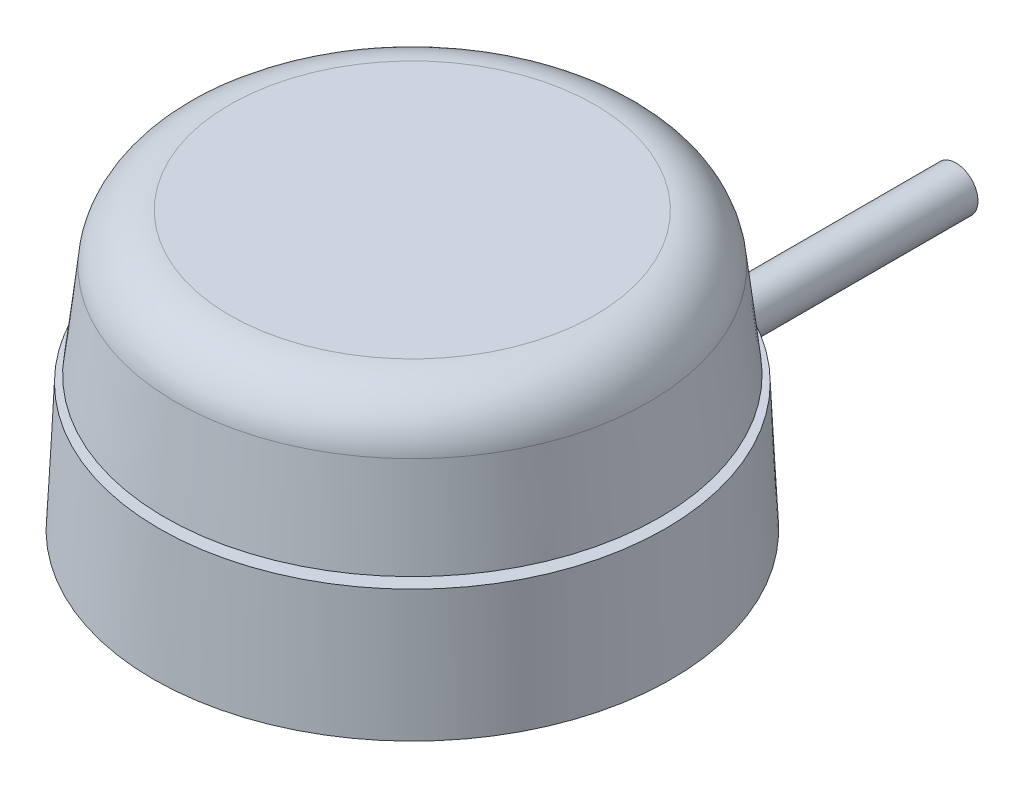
ISO-10303-21;
HEADER;
FILE_DESCRIPTION(('STEP AP214'),'2;1');
FILE_NAME('part.step','',(''),(''),'','','');
FILE_SCHEMA(('AUTOMOTIVE_DESIGN { 1 0 10303 214 1 1 1 1 }'));
ENDSEC;
DATA;
#1=APPLICATION_CONTEXT('core data for automotive mechanical design processes');
#2=APPLICATION_PROTOCOL_DEFINITION('international standard','automotive_design',2000,#1);
#3=PRODUCT_CONTEXT('',#1,'mechanical');
#4=PRODUCT('Part','Part','',(#3));
#5=PRODUCT_RELATED_PRODUCT_CATEGORY('part','',(#4));
#6=PRODUCT_DEFINITION_FORMATION('','',#4);
#7=PRODUCT_DEFINITION_CONTEXT('part definition',#1,'design');
#8=PRODUCT_DEFINITION('design','',#6,#7);
#9=PRODUCT_DEFINITION_SHAPE('','',#8);
#10=(LENGTH_UNIT() NAMED_UNIT(*) SI_UNIT(.MILLI.,.METRE.));
#11=(NAMED_UNIT(*) PLANE_ANGLE_UNIT() SI_UNIT($,.RADIAN.));
#12=(NAMED_UNIT(*) SI_UNIT($,.STERADIAN.) SOLID_ANGLE_UNIT());
#13=UNCERTAINTY_MEASURE_WITH_UNIT(LENGTH_MEASURE(1.E-05),#10,'distance_accuracy_value','');
#14=(GEOMETRIC_REPRESENTATION_CONTEXT(3) GLOBAL_UNCERTAINTY_ASSIGNED_CONTEXT((#13)) GLOBAL_UNIT_ASSIGNED_CONTEXT((#10,
#11,#12)) REPRESENTATION_CONTEXT('',''));
#15=CARTESIAN_POINT('',(0.,0.,0.));
#16=DIRECTION('',(0.,0.,1.));
#17=DIRECTION('',(1.,0.,0.));
#18=AXIS2_PLACEMENT_3D('',#15,#16,#17);
#19=CARTESIAN_POINT('',(1.,-0.00100000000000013,-38.8901171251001));
#20=DIRECTION('',(-1.,0.,0.));
#21=DIRECTION('',(0.,0.,1.));
#22=AXIS2_PLACEMENT_3D('',#19,#20,#21);
#23=PLANE('',#22);
#24=DIRECTION('',(0.,0.,-1.));
#25=VECTOR('',#24,1.);
#26=CARTESIAN_POINT('',(1.,6.59232921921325,-29.697728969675));
#27=LINE('',#26,#25);
#28=CARTESIAN_POINT('',(1.,6.59232921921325,-40.3901171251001));
#29=VERTEX_POINT('',#28);
#30=CARTESIAN_POINT('',(1.,6.59232921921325,-38.8901171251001));
#31=VERTEX_POINT('',#30);
#32=EDGE_CURVE('P0_E255',#29,#31,#27,.F.);
#33=ORIENTED_EDGE('',*,*,#32,.F.);
#34=DIRECTION('',(0.,1.,0.));
#35=VECTOR('',#34,1.);
#36=CARTESIAN_POINT('',(1.,-0.00100000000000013,-40.3901171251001));
#37=LINE('',#36,#35);
#38=CARTESIAN_POINT('',(1.,6.75,-40.3901171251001));
#39=VERTEX_POINT('',#38);
#40=EDGE_CURVE('P0_E361',#29,#39,#37,.T.);
#41=ORIENTED_EDGE('',*,*,#40,.T.);
#42=DIRECTION('',(0.,0.,1.));
#43=VECTOR('',#42,1.);
#44=CARTESIAN_POINT('',(1.,6.75,-38.8901171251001));
#45=LINE('',#44,#43);
#46=CARTESIAN_POINT('',(1.,6.75,-38.8901171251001));
#47=VERTEX_POINT('',#46);
#48=EDGE_CURVE('P0_E356',#39,#47,#45,.T.);
#49=ORIENTED_EDGE('',*,*,#48,.T.);
#50=DIRECTION('',(0.,1.,0.));
#51=VECTOR('',#50,1.);
#52=CARTESIAN_POINT('',(1.,-0.00100000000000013,-38.8901171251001));
#53=LINE('',#52,#51);
#54=EDGE_CURVE('P0_E365',#31,#47,#53,.T.);
#55=ORIENTED_EDGE('',*,*,#54,.F.);
#56=EDGE_LOOP('',(#33,#41,#49,#55));
#57=FACE_BOUND('',#56,.T.);
#58=ADVANCED_FACE('P0_F16',(#57),#23,.F.);
#59=DIRECTION('',(0.,0.,-1.));
#60=VECTOR('',#59,1.);
#61=CARTESIAN_POINT('',(1.,0.407670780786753,-29.697728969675));
#62=LINE('',#61,#60);
#63=CARTESIAN_POINT('',(1.,0.407670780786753,-38.8901171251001));
#64=VERTEX_POINT('',#63);
#65=CARTESIAN_POINT('',(1.,0.407670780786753,-40.3901171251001));
#66=VERTEX_POINT('',#65);
#67=EDGE_CURVE('P0_E39',#64,#66,#62,.T.);
#68=ORIENTED_EDGE('',*,*,#67,.F.);
#69=CARTESIAN_POINT('',(1.,0.25,-38.8901171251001));
#70=VERTEX_POINT('',#69);
#71=EDGE_CURVE('P0_E362',#70,#64,#53,.T.);
#72=ORIENTED_EDGE('',*,*,#71,.F.);
#73=DIRECTION('',(0.,0.,1.));
#74=VECTOR('',#73,1.);
#75=CARTESIAN_POINT('',(1.,0.25,-38.8901171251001));
#76=LINE('',#75,#74);
#77=CARTESIAN_POINT('',(1.,0.25,-40.3901171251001));
#78=VERTEX_POINT('',#77);
#79=EDGE_CURVE('P0_E347',#78,#70,#76,.T.);
#80=ORIENTED_EDGE('',*,*,#79,.F.);
#81=EDGE_CURVE('P0_E366',#78,#66,#37,.T.);
#82=ORIENTED_EDGE('',*,*,#81,.T.);
#83=EDGE_LOOP('',(#68,#72,#80,#82));
#84=FACE_BOUND('',#83,.T.);
#85=ADVANCED_FACE('P0_F532',(#84),#23,.F.);
#86=CARTESIAN_POINT('',(-0.999999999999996,-0.00100000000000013,-43.8901171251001));
#87=DIRECTION('',(1.,0.,0.));
#88=DIRECTION('',(0.,0.,-1.));
#89=AXIS2_PLACEMENT_3D('',#86,#87,#88);
#90=PLANE('',#89);
#91=DIRECTION('',(0.,0.,-1.));
#92=VECTOR('',#91,1.);
#93=CARTESIAN_POINT('',(-1.,0.407670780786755,-29.697728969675));
#94=LINE('',#93,#92);
#95=CARTESIAN_POINT('',(-0.999999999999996,0.407670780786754,-43.8901171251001));
#96=VERTEX_POINT('',#95);
#97=CARTESIAN_POINT('',(-0.999999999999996,0.407670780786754,-42.3901171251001));
#98=VERTEX_POINT('',#97);
#99=EDGE_CURVE('P0_E248',#96,#98,#94,.F.);
#100=ORIENTED_EDGE('',*,*,#99,.F.);
#101=DIRECTION('',(0.,1.,0.));
#102=VECTOR('',#101,1.);
#103=CARTESIAN_POINT('',(-0.999999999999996,-0.00100000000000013,-43.8901171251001));
#104=LINE('',#103,#102);
#105=CARTESIAN_POINT('',(-0.999999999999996,0.249999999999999,-43.8901171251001));
#106=VERTEX_POINT('',#105);
#107=EDGE_CURVE('P0_E333',#106,#96,#104,.T.);
#108=ORIENTED_EDGE('',*,*,#107,.F.);
#109=DIRECTION('',(0.,0.,-1.));
#110=VECTOR('',#109,1.);
#111=CARTESIAN_POINT('',(-0.999999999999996,0.249999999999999,-43.8901171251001));
#112=LINE('',#111,#110);
#113=CARTESIAN_POINT('',(-0.999999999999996,0.249999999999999,-42.3901171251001));
#114=VERTEX_POINT('',#113);
#115=EDGE_CURVE('P0_E318',#114,#106,#112,.T.);
#116=ORIENTED_EDGE('',*,*,#115,.F.);
#117=DIRECTION('',(0.,1.,0.));
#118=VECTOR('',#117,1.);
#119=CARTESIAN_POINT('',(-0.999999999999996,-0.00100000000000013,-42.3901171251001));
#120=LINE('',#119,#118);
#121=EDGE_CURVE('P0_E337',#114,#98,#120,.T.);
#122=ORIENTED_EDGE('',*,*,#121,.T.);
#123=EDGE_LOOP('',(#100,#108,#116,#122));
#124=FACE_BOUND('',#123,.T.);
#125=ADVANCED_FACE('P0_F538',(#124),#90,.F.);
#126=DIRECTION('',(0.,0.,-1.));
#127=VECTOR('',#126,1.);
#128=CARTESIAN_POINT('',(-1.,6.59232921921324,-29.697728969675));
#129=LINE('',#128,#127);
#130=CARTESIAN_POINT('',(-0.999999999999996,6.59232921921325,-42.3901171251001));
#131=VERTEX_POINT('',#130);
#132=CARTESIAN_POINT('',(-0.999999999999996,6.59232921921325,-43.8901171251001));
#133=VERTEX_POINT('',#132);
#134=EDGE_CURVE('P0_E245',#131,#133,#129,.T.);
#135=ORIENTED_EDGE('',*,*,#134,.F.);
#136=CARTESIAN_POINT('',(-0.999999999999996,6.75,-42.3901171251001));
#137=VERTEX_POINT('',#136);
#138=EDGE_CURVE('P0_E332',#131,#137,#120,.T.);
#139=ORIENTED_EDGE('',*,*,#138,.T.);
#140=DIRECTION('',(0.,0.,-1.));
#141=VECTOR('',#140,1.);
#142=CARTESIAN_POINT('',(-0.999999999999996,6.75,-43.8901171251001));
#143=LINE('',#142,#141);
#144=CARTESIAN_POINT('',(-0.999999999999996,6.75,-43.8901171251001));
#145=VERTEX_POINT('',#144);
#146=EDGE_CURVE('P0_E327',#137,#145,#143,.T.);
#147=ORIENTED_EDGE('',*,*,#146,.T.);
#148=EDGE_CURVE('P0_E336',#133,#145,#104,.T.);
#149=ORIENTED_EDGE('',*,*,#148,.F.);
#150=EDGE_LOOP('',(#135,#139,#147,#149));
#151=FACE_BOUND('',#150,.T.);
#152=ADVANCED_FACE('P0_F578',(#151),#90,.F.);
#153=CARTESIAN_POINT('',(1.,-0.00100000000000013,-43.8901171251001));
#154=DIRECTION('',(-1.,0.,0.));
#155=DIRECTION('',(0.,0.,1.));
#156=AXIS2_PLACEMENT_3D('',#153,#154,#155);
#157=PLANE('',#156);
#158=DIRECTION('',(0.,0.,-1.));
#159=VECTOR('',#158,1.);
#160=CARTESIAN_POINT('',(1.,6.59232921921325,-29.697728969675));
#161=LINE('',#160,#159);
#162=CARTESIAN_POINT('',(1.,6.59232921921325,-43.8901171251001));
#163=VERTEX_POINT('',#162);
#164=CARTESIAN_POINT('',(1.,6.59232921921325,-42.3901171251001));
#165=VERTEX_POINT('',#164);
#166=EDGE_CURVE('P0_E234',#163,#165,#161,.F.);
#167=ORIENTED_EDGE('',*,*,#166,.F.);
#168=DIRECTION('',(0.,1.,0.));
#169=VECTOR('',#168,1.);
#170=CARTESIAN_POINT('',(1.,-0.00100000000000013,-43.8901171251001));
#171=LINE('',#170,#169);
#172=CARTESIAN_POINT('',(1.,6.75,-43.8901171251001));
#173=VERTEX_POINT('',#172);
#174=EDGE_CURVE('P0_E218',#163,#173,#171,.T.);
#175=ORIENTED_EDGE('',*,*,#174,.T.);
#176=DIRECTION('',(0.,0.,1.));
#177=VECTOR('',#176,1.);
#178=CARTESIAN_POINT('',(1.,6.75,-43.8901171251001));
#179=LINE('',#178,#177);
#180=CARTESIAN_POINT('',(1.,6.75,-42.3901171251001));
#181=VERTEX_POINT('',#180);
#182=EDGE_CURVE('P0_E305',#173,#181,#179,.T.);
#183=ORIENTED_EDGE('',*,*,#182,.T.);
#184=DIRECTION('',(0.,1.,0.));
#185=VECTOR('',#184,1.);
#186=CARTESIAN_POINT('',(1.,-0.00100000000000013,-42.3901171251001));
#187=LINE('',#186,#185);
#188=EDGE_CURVE('P0_E217',#165,#181,#187,.T.);
#189=ORIENTED_EDGE('',*,*,#188,.F.);
#190=EDGE_LOOP('',(#167,#175,#183,#189));
#191=FACE_BOUND('',#190,.T.);
#192=ADVANCED_FACE('P0_F639',(#191),#157,.F.);
#193=DIRECTION('',(0.,0.,-1.));
#194=VECTOR('',#193,1.);
#195=CARTESIAN_POINT('',(1.,0.407670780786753,-29.697728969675));
#196=LINE('',#195,#194);
#197=CARTESIAN_POINT('',(1.,0.407670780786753,-42.3901171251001));
#198=VERTEX_POINT('',#197);
#199=CARTESIAN_POINT('',(1.,0.407670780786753,-43.8901171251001));
#200=VERTEX_POINT('',#199);
#201=EDGE_CURVE('P0_E211',#198,#200,#196,.T.);
#202=ORIENTED_EDGE('',*,*,#201,.F.);
#203=CARTESIAN_POINT('',(1.,0.25,-42.3901171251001));
#204=VERTEX_POINT('',#203);
#205=EDGE_CURVE('P0_E310',#204,#198,#187,.T.);
#206=ORIENTED_EDGE('',*,*,#205,.F.);
#207=DIRECTION('',(0.,0.,1.));
#208=VECTOR('',#207,1.);
#209=CARTESIAN_POINT('',(1.,0.25,-43.8901171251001));
#210=LINE('',#209,#208);
#211=CARTESIAN_POINT('',(1.,0.25,-43.8901171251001));
#212=VERTEX_POINT('',#211);
#213=EDGE_CURVE('P0_E214',#212,#204,#210,.T.);
#214=ORIENTED_EDGE('',*,*,#213,.F.);
#215=EDGE_CURVE('P0_E207',#212,#200,#171,.T.);
#216=ORIENTED_EDGE('',*,*,#215,.T.);
#217=EDGE_LOOP('',(#202,#206,#214,#216));
#218=FACE_BOUND('',#217,.T.);
#219=ADVANCED_FACE('P0_F209',(#218),#157,.F.);
#220=CARTESIAN_POINT('',(-0.999999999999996,-0.00100000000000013,-38.8901171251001));
#221=DIRECTION('',(1.,0.,0.));
#222=DIRECTION('',(0.,0.,-1.));
#223=AXIS2_PLACEMENT_3D('',#220,#221,#222);
#224=PLANE('',#223);
#225=DIRECTION('',(0.,0.,-1.));
#226=VECTOR('',#225,1.);
#227=CARTESIAN_POINT('',(-0.999999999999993,0.407670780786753,-29.697728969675));
#228=LINE('',#227,#226);
#229=CARTESIAN_POINT('',(-0.999999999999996,0.407670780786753,-40.3901171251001));
#230=VERTEX_POINT('',#229);
#231=CARTESIAN_POINT('',(-0.999999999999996,0.407670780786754,-38.8901171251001));
#232=VERTEX_POINT('',#231);
#233=EDGE_CURVE('P0_E11',#230,#232,#228,.F.);
#234=ORIENTED_EDGE('',*,*,#233,.F.);
#235=DIRECTION('',(0.,1.,0.));
#236=VECTOR('',#235,1.);
#237=CARTESIAN_POINT('',(-0.999999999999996,-0.00100000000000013,-40.3901171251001));
#238=LINE('',#237,#236);
#239=CARTESIAN_POINT('',(-0.999999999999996,0.249999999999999,-40.3901171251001));
#240=VERTEX_POINT('',#239);
#241=EDGE_CURVE('P0_E280',#240,#230,#238,.T.);
#242=ORIENTED_EDGE('',*,*,#241,.F.);
#243=DIRECTION('',(0.,0.,-1.));
#244=VECTOR('',#243,1.);
#245=CARTESIAN_POINT('',(-0.999999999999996,0.249999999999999,-38.8901171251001));
#246=LINE('',#245,#244);
#247=CARTESIAN_POINT('',(-0.999999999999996,0.249999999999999,-38.8901171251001));
#248=VERTEX_POINT('',#247);
#249=EDGE_CURVE('P0_E283',#248,#240,#246,.T.);
#250=ORIENTED_EDGE('',*,*,#249,.F.);
#251=DIRECTION('',(0.,1.,0.));
#252=VECTOR('',#251,1.);
#253=CARTESIAN_POINT('',(-0.999999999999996,-0.00100000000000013,-38.8901171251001));
#254=LINE('',#253,#252);
#255=EDGE_CURVE('P0_E285',#248,#232,#254,.T.);
#256=ORIENTED_EDGE('',*,*,#255,.T.);
#257=EDGE_LOOP('',(#234,#242,#250,#256));
#258=FACE_BOUND('',#257,.T.);
#259=ADVANCED_FACE('P0_F614',(#258),#224,.F.);
#260=DIRECTION('',(0.,0.,-1.));
#261=VECTOR('',#260,1.);
#262=CARTESIAN_POINT('',(-0.999999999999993,6.59232921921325,-29.697728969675));
#263=LINE('',#262,#261);
#264=CARTESIAN_POINT('',(-0.999999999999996,6.59232921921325,-38.8901171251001));
#265=VERTEX_POINT('',#264);
#266=CARTESIAN_POINT('',(-0.999999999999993,6.59232921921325,-40.3901171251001));
#267=VERTEX_POINT('',#266);
#268=EDGE_CURVE('P0_E24',#265,#267,#263,.T.);
#269=ORIENTED_EDGE('',*,*,#268,.F.);
#270=CARTESIAN_POINT('',(-0.999999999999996,6.75,-38.8901171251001));
#271=VERTEX_POINT('',#270);
#272=EDGE_CURVE('P0_E279',#265,#271,#254,.T.);
#273=ORIENTED_EDGE('',*,*,#272,.T.);
#274=DIRECTION('',(0.,0.,-1.));
#275=VECTOR('',#274,1.);
#276=CARTESIAN_POINT('',(-0.999999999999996,6.75,-38.8901171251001));
#277=LINE('',#276,#275);
#278=CARTESIAN_POINT('',(-0.999999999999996,6.75,-40.3901171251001));
#279=VERTEX_POINT('',#278);
#280=EDGE_CURVE('P0_E274',#271,#279,#277,.T.);
#281=ORIENTED_EDGE('',*,*,#280,.T.);
#282=EDGE_CURVE('P0_E284',#267,#279,#238,.T.);
#283=ORIENTED_EDGE('',*,*,#282,.F.);
#284=EDGE_LOOP('',(#269,#273,#281,#283));
#285=FACE_BOUND('',#284,.T.);
#286=ADVANCED_FACE('P0_F606',(#285),#224,.F.);
#287=CARTESIAN_POINT('',(1.5,3.5,-45.));
#288=DIRECTION('',(0.,0.,1.));
#289=DIRECTION('',(1.,0.,0.));
#290=AXIS2_PLACEMENT_3D('',#287,#288,#289);
#291=CYLINDRICAL_SURFACE('',#290,3.25);
#292=CARTESIAN_POINT('',(1.5,3.5,-43.8901171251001));
#293=DIRECTION('',(0.,0.,-1.));
#294=DIRECTION('',(-1.,0.,0.));
#295=AXIS2_PLACEMENT_3D('',#292,#293,#294);
#296=CIRCLE('',#295,3.25);
#297=CARTESIAN_POINT('',(1.5,6.75,-43.8901171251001));
#298=VERTEX_POINT('',#297);
#299=CARTESIAN_POINT('',(1.5,0.25,-43.8901171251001));
#300=VERTEX_POINT('',#299);
#301=EDGE_CURVE('P0_E294',#298,#300,#296,.T.);
#302=ORIENTED_EDGE('',*,*,#301,.T.);
#303=DIRECTION('',(0.,0.,1.));
#304=VECTOR('',#303,1.);
#305=CARTESIAN_POINT('',(1.5,0.25,-45.));
#306=LINE('',#305,#304);
#307=CARTESIAN_POINT('',(1.5,0.25,-45.));
#308=VERTEX_POINT('',#307);
#309=EDGE_CURVE('P0_E384',#308,#300,#306,.T.);
#310=ORIENTED_EDGE('',*,*,#309,.F.);
#311=CARTESIAN_POINT('',(1.5,3.5,-45.));
#312=DIRECTION('',(0.,0.,1.));
#313=DIRECTION('',(1.,0.,0.));
#314=AXIS2_PLACEMENT_3D('',#311,#312,#313);
#315=CIRCLE('',#314,3.25);
#316=CARTESIAN_POINT('',(1.5,6.75,-45.));
#317=VERTEX_POINT('',#316);
#318=EDGE_CURVE('P0_E370',#308,#317,#315,.T.);
#319=ORIENTED_EDGE('',*,*,#318,.T.);
#320=DIRECTION('',(0.,0.,1.));
#321=VECTOR('',#320,1.);
#322=CARTESIAN_POINT('',(1.5,6.75,-45.));
#323=LINE('',#322,#321);
#324=EDGE_CURVE('P0_E400',#317,#298,#323,.T.);
#325=ORIENTED_EDGE('',*,*,#324,.T.);
#326=EDGE_LOOP('',(#302,#310,#319,#325));
#327=FACE_BOUND('',#326,.T.);
#328=ADVANCED_FACE('P0_F481',(#327),#291,.T.);
#329=CARTESIAN_POINT('',(-1.5,3.5,-45.));
#330=DIRECTION('',(0.,0.,1.));
#331=DIRECTION('',(1.,0.,0.));
#332=AXIS2_PLACEMENT_3D('',#329,#330,#331);
#333=CYLINDRICAL_SURFACE('',#332,3.25);
#334=CARTESIAN_POINT('',(-1.5,3.5,-38.8901171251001));
#335=DIRECTION('',(0.,0.,1.));
#336=DIRECTION('',(1.,0.,0.));
#337=AXIS2_PLACEMENT_3D('',#334,#335,#336);
#338=CIRCLE('',#337,3.25);
#339=CARTESIAN_POINT('',(-1.5,6.75,-38.8901171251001));
#340=VERTEX_POINT('',#339);
#341=CARTESIAN_POINT('',(-1.5,0.249999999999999,-38.8901171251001));
#342=VERTEX_POINT('',#341);
#343=EDGE_CURVE('P0_E262',#340,#342,#338,.T.);
#344=ORIENTED_EDGE('',*,*,#343,.T.);
#345=DIRECTION('',(0.,0.,1.));
#346=VECTOR('',#345,1.);
#347=CARTESIAN_POINT('',(-1.5,0.249999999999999,-45.));
#348=LINE('',#347,#346);
#349=CARTESIAN_POINT('',(-1.5,0.249999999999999,-38.0838046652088));
#350=VERTEX_POINT('',#349);
#351=EDGE_CURVE('P0_E394',#342,#350,#348,.T.);
#352=ORIENTED_EDGE('',*,*,#351,.T.);
#353=CARTESIAN_POINT('',(-1.4998,6.74999999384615,-37.7802421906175));
#354=CARTESIAN_POINT('',(-1.59131455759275,6.75001434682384,-37.7766118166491));
#355=CARTESIAN_POINT('',(-1.68281860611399,6.74614595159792,-37.772823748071));
#356=CARTESIAN_POINT('',(-1.86515899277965,6.73071444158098,-37.7649785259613));
#357=CARTESIAN_POINT('',(-1.95599536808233,6.71915175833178,-37.7609213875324));
#358=CARTESIAN_POINT('',(-2.13630002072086,6.688413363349,-37.7525868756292));
#359=CARTESIAN_POINT('',(-2.22576922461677,6.66924306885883,-37.7483096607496));
#360=CARTESIAN_POINT('',(-2.40274412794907,6.62344667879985,-37.7396001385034));
#361=CARTESIAN_POINT('',(-2.49024984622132,6.59682065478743,-37.7351678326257));
#362=CARTESIAN_POINT('',(-2.74897182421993,6.50597899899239,-37.7217470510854));
#363=CARTESIAN_POINT('',(-2.91647626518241,6.43078549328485,-37.7126307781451));
#364=CARTESIAN_POINT('',(-3.2363677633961,6.25336567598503,-37.6948390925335));
#365=CARTESIAN_POINT('',(-3.38875748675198,6.15114414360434,-37.686163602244));
#366=CARTESIAN_POINT('',(-3.67431365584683,5.9224593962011,-37.6701179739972));
#367=CARTESIAN_POINT('',(-3.80747348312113,5.79598786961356,-37.662748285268));
#368=CARTESIAN_POINT('',(-4.0506881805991,5.52237585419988,-37.6502104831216));
#369=CARTESIAN_POINT('',(-4.16074017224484,5.3752327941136,-37.6450426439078));
#370=CARTESIAN_POINT('',(-4.35422016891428,5.06500162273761,-37.6377286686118));
#371=CARTESIAN_POINT('',(-4.43773755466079,4.90196951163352,-37.6355723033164));
#372=CARTESIAN_POINT('',(-4.57624152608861,4.56421288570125,-37.6348612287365));
#373=CARTESIAN_POINT('',(-4.63123099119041,4.3894895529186,-37.6363061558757));
#374=CARTESIAN_POINT('',(-4.71091701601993,4.03429397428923,-37.643120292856));
#375=CARTESIAN_POINT('',(-4.73576879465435,3.85385613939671,-37.6484691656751));
#376=CARTESIAN_POINT('',(-4.75504898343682,3.49151984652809,-37.6630823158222));
#377=CARTESIAN_POINT('',(-4.74947691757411,3.30962136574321,-37.6723466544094));
#378=CARTESIAN_POINT('',(-4.70816389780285,2.94951758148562,-37.6944672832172));
#379=CARTESIAN_POINT('',(-4.67242360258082,2.77131219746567,-37.7073234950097));
#380=CARTESIAN_POINT('',(-4.57189096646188,2.42354637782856,-37.7359919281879));
#381=CARTESIAN_POINT('',(-4.50709743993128,2.25398629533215,-37.7518042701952));
#382=CARTESIAN_POINT('',(-4.34974560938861,1.92690189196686,-37.7856229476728));
#383=CARTESIAN_POINT('',(-4.25697845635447,1.76947969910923,-37.8036451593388));
#384=CARTESIAN_POINT('',(-4.04649798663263,1.47244398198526,-37.8406935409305));
#385=CARTESIAN_POINT('',(-3.92878448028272,1.33283059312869,-37.8597197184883));
#386=CARTESIAN_POINT('',(-3.67063078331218,1.07419854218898,-37.8977484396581));
#387=CARTESIAN_POINT('',(-3.53001631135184,0.955353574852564,-37.9167495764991));
#388=CARTESIAN_POINT('',(-3.2305870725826,0.742961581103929,-37.9533807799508));
#389=CARTESIAN_POINT('',(-3.07176650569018,0.649422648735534,-37.9710104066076));
#390=CARTESIAN_POINT('',(-2.74040974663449,0.490401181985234,-38.0038024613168));
#391=CARTESIAN_POINT('',(-2.56787126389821,0.424923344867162,-38.018964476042));
#392=CARTESIAN_POINT('',(-2.21410624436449,0.324112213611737,-38.0459142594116));
#393=CARTESIAN_POINT('',(-2.03289406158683,0.288730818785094,-38.0577073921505));
#394=CARTESIAN_POINT('',(-1.79193361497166,0.26260543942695,-38.07064166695));
#395=CARTESIAN_POINT('',(-1.73356983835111,0.257873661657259,-38.0735649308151));
#396=CARTESIAN_POINT('',(-1.61674819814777,0.25157340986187,-38.0789981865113));
#397=CARTESIAN_POINT('',(-1.55829064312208,0.249999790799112,-38.0815088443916));
#398=CARTESIAN_POINT('',(-1.4998,0.250000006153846,-38.0838125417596));
#399=B_SPLINE_CURVE_WITH_KNOTS('',3,(#353,#354,#355,#356,#357,#358,#359,#360,#361,#362,#363,
#364,#365,#366,#367,#368,#369,#370,#371,#372,#373,#374,#375,#376,#377,#378,#379,#380,#381,#382,
#383,#384,#385,#386,#387,#388,#389,#390,#391,#392,#393,#394,#395,#396,#397,#398),.UNSPECIFIED.,
.F.,.F.,(4,2,2,2,2,2,2,2,2,2,2,2,2,2,2,2,2,2,2,2,2,2,4),(0.,0.274669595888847,0.549323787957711,
0.82378275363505,1.09823908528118,1.64690094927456,2.19546586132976,2.74421912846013,
3.29304071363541,3.83999351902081,4.38689110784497,4.93095986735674,5.47503713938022,
6.01910253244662,6.56319013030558,7.11144488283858,7.6597038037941,8.21234883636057,
8.76517042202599,9.31808451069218,9.87011325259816,10.0459363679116,10.2214728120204),.UNSPECIFIED.);
#400=CARTESIAN_POINT('',(-1.5,6.75,-37.7802342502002));
#401=VERTEX_POINT('',#400);
#402=EDGE_CURVE('P0_E446',#401,#350,#399,.T.);
#403=ORIENTED_EDGE('',*,*,#402,.F.);
#404=DIRECTION('',(0.,0.,1.));
#405=VECTOR('',#404,1.);
#406=CARTESIAN_POINT('',(-1.5,6.75,-45.));
#407=LINE('',#406,#405);
#408=EDGE_CURVE('P0_E399',#340,#401,#407,.T.);
#409=ORIENTED_EDGE('',*,*,#408,.F.);
#410=EDGE_LOOP('',(#344,#352,#403,#409));
#411=FACE_BOUND('',#410,.T.);
#412=ADVANCED_FACE('P0_F469',(#411),#333,.T.);
#413=CARTESIAN_POINT('',(-1.5,3.5,-43.8901171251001));
#414=DIRECTION('',(0.,0.,-1.));
#415=DIRECTION('',(-1.,0.,0.));
#416=AXIS2_PLACEMENT_3D('',#413,#414,#415);
#417=CIRCLE('',#416,3.25);
#418=CARTESIAN_POINT('',(-1.5,0.249999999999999,-43.8901171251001));
#419=VERTEX_POINT('',#418);
#420=CARTESIAN_POINT('',(-1.5,6.75,-43.8901171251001));
#421=VERTEX_POINT('',#420);
#422=EDGE_CURVE('P0_E315',#419,#421,#417,.T.);
#423=ORIENTED_EDGE('',*,*,#422,.T.);
#424=CARTESIAN_POINT('',(-1.5,6.75,-45.));
#425=VERTEX_POINT('',#424);
#426=EDGE_CURVE('P0_E395',#425,#421,#407,.T.);
#427=ORIENTED_EDGE('',*,*,#426,.F.);
#428=CARTESIAN_POINT('',(-1.5,3.5,-45.));
#429=DIRECTION('',(0.,0.,1.));
#430=DIRECTION('',(1.,0.,0.));
#431=AXIS2_PLACEMENT_3D('',#428,#429,#430);
#432=CIRCLE('',#431,3.25);
#433=CARTESIAN_POINT('',(-1.5,0.249999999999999,-45.));
#434=VERTEX_POINT('',#433);
#435=EDGE_CURVE('P0_E377',#425,#434,#432,.T.);
#436=ORIENTED_EDGE('',*,*,#435,.T.);
#437=EDGE_CURVE('P0_E390',#434,#419,#348,.T.);
#438=ORIENTED_EDGE('',*,*,#437,.T.);
#439=EDGE_LOOP('',(#423,#427,#436,#438));
#440=FACE_BOUND('',#439,.T.);
#441=ADVANCED_FACE('P0_F470',(#440),#333,.T.);
#442=CARTESIAN_POINT('',(1.5,3.5,-38.8901171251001));
#443=DIRECTION('',(0.,0.,1.));
#444=DIRECTION('',(1.,0.,0.));
#445=AXIS2_PLACEMENT_3D('',#442,#443,#444);
#446=CIRCLE('',#445,3.25);
#447=CARTESIAN_POINT('',(1.5,0.25,-38.8901171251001));
#448=VERTEX_POINT('',#447);
#449=CARTESIAN_POINT('',(1.5,6.75,-38.8901171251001));
#450=VERTEX_POINT('',#449);
#451=EDGE_CURVE('P0_E344',#448,#450,#446,.T.);
#452=ORIENTED_EDGE('',*,*,#451,.T.);
#453=CARTESIAN_POINT('',(1.5,6.75,-37.7802342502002));
#454=VERTEX_POINT('',#453);
#455=EDGE_CURVE('P0_E383',#450,#454,#323,.T.);
#456=ORIENTED_EDGE('',*,*,#455,.T.);
#457=CARTESIAN_POINT('',(1.4998,0.250000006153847,-38.0838125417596));
#458=CARTESIAN_POINT('',(1.59110655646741,0.249985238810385,-38.0802206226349));
#459=CARTESIAN_POINT('',(1.68238759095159,0.253836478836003,-38.0761139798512));
#460=CARTESIAN_POINT('',(1.86424607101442,0.269189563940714,-38.0669243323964));
#461=CARTESIAN_POINT('',(1.95482358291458,0.280690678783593,-38.0618414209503));
#462=CARTESIAN_POINT('',(2.13454141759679,0.311245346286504,-38.0507577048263));
#463=CARTESIAN_POINT('',(2.2236832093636,0.330290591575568,-38.044757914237));
#464=CARTESIAN_POINT('',(2.39997517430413,0.375765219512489,-38.0319179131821));
#465=CARTESIAN_POINT('',(2.4871253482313,0.402194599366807,-38.0250777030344));
#466=CARTESIAN_POINT('',(2.74471327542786,0.492308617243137,-38.003426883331));
#467=CARTESIAN_POINT('',(2.91140702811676,0.56683944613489,-37.9874786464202));
#468=CARTESIAN_POINT('',(3.22974023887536,0.74253722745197,-37.9535125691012));
#469=CARTESIAN_POINT('',(3.38138033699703,0.843703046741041,-37.9354948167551));
#470=CARTESIAN_POINT('',(3.66658994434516,1.07063693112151,-37.8983556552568));
#471=CARTESIAN_POINT('',(3.80002781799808,1.19656962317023,-37.8792275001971));
#472=CARTESIAN_POINT('',(4.04388523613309,1.46909002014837,-37.841181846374));
#473=CARTESIAN_POINT('',(4.1543012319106,1.61568090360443,-37.8222643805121));
#474=CARTESIAN_POINT('',(4.34943770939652,1.926160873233,-37.7857387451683));
#475=CARTESIAN_POINT('',(4.43404032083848,2.090124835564,-37.7681368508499));
#476=CARTESIAN_POINT('',(4.57438535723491,2.4301935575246,-37.7354105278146));
#477=CARTESIAN_POINT('',(4.6301303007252,2.60629725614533,-37.7202858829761));
#478=CARTESIAN_POINT('',(4.71083639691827,2.96466728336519,-37.6934378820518));
#479=CARTESIAN_POINT('',(4.73596292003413,3.14689499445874,-37.6816965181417));
#480=CARTESIAN_POINT('',(4.75514293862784,3.51318629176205,-37.6620519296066));
#481=CARTESIAN_POINT('',(4.74919754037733,3.69724981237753,-37.654148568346));
#482=CARTESIAN_POINT('',(4.7065186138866,4.060200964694,-37.6424369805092));
#483=CARTESIAN_POINT('',(4.67006562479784,4.23912044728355,-37.6385921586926));
#484=CARTESIAN_POINT('',(4.5677419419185,4.58837969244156,-37.6347280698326));
#485=CARTESIAN_POINT('',(4.50187193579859,4.75871965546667,-37.6347087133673));
#486=CARTESIAN_POINT('',(4.34284734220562,5.08544223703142,-37.6380411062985));
#487=CARTESIAN_POINT('',(4.24977901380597,5.24186697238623,-37.641382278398));
#488=CARTESIAN_POINT('',(4.03893005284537,5.53696305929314,-37.6507387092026));
#489=CARTESIAN_POINT('',(3.92115002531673,5.6756348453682,-37.6567539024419));
#490=CARTESIAN_POINT('',(3.66369745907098,5.93187793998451,-37.6706595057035));
#491=CARTESIAN_POINT('',(3.52394146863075,6.04936499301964,-37.6785571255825));
#492=CARTESIAN_POINT('',(3.22674397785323,6.25934093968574,-37.6953357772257));
#493=CARTESIAN_POINT('',(3.06929660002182,6.35182149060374,-37.7042171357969));
#494=CARTESIAN_POINT('',(2.74032655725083,6.50957927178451,-37.7221755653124));
#495=CARTESIAN_POINT('',(2.56873369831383,6.57470968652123,-37.7312534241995));
#496=CARTESIAN_POINT('',(2.21715027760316,6.67513980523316,-37.7488458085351));
#497=CARTESIAN_POINT('',(2.03717261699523,6.71048383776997,-37.7573611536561));
#498=CARTESIAN_POINT('',(1.79658026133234,6.7369894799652,-37.7679475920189));
#499=CARTESIAN_POINT('',(1.73728020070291,6.74187393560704,-37.7704935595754));
#500=CARTESIAN_POINT('',(1.61859572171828,6.74837662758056,-37.7754613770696));
#501=CARTESIAN_POINT('',(1.55921161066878,6.7500003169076,-37.7778834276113));
#502=CARTESIAN_POINT('',(1.4998,6.74999999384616,-37.7802421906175));
#503=B_SPLINE_CURVE_WITH_KNOTS('',3,(#457,#458,#459,#460,#461,#462,#463,#464,#465,#466,#467,
#468,#469,#470,#471,#472,#473,#474,#475,#476,#477,#478,#479,#480,#481,#482,#483,#484,#485,#486,
#487,#488,#489,#490,#491,#492,#493,#494,#495,#496,#497,#498,#499,#500,#501,#502),.UNSPECIFIED.,
.F.,.F.,(4,2,2,2,2,2,2,2,2,2,2,2,2,2,2,2,2,2,2,2,2,2,4),(0.,0.27403926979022,0.54805238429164,
0.821764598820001,1.09547670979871,1.64254382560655,2.18958767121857,2.74039876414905,
3.2912946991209,3.84466975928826,4.39799651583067,4.94832131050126,5.49862651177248,
6.04392616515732,6.589213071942,7.13278903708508,7.67635169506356,8.22203068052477,
8.76789149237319,9.31664614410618,9.86458268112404,10.0431844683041,10.2214873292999),.UNSPECIFIED.);
#504=CARTESIAN_POINT('',(1.5,0.25,-38.0838046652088));
#505=VERTEX_POINT('',#504);
#506=EDGE_CURVE('P0_E453',#505,#454,#503,.T.);
#507=ORIENTED_EDGE('',*,*,#506,.F.);
#508=EDGE_CURVE('P0_E389',#448,#505,#306,.T.);
#509=ORIENTED_EDGE('',*,*,#508,.F.);
#510=EDGE_LOOP('',(#452,#456,#507,#509));
#511=FACE_BOUND('',#510,.T.);
#512=ADVANCED_FACE('P0_F482',(#511),#291,.T.);
#513=CARTESIAN_POINT('',(0.,0.,0.));
#514=DIRECTION('',(0.,1.,0.));
#515=DIRECTION('',(0.,0.,1.));
#516=AXIS2_PLACEMENT_3D('',#513,#514,#515);
#517=PLANE('',#516);
#518=CARTESIAN_POINT('',(21.,0.,21.));
#519=DIRECTION('',(0.,-1.,0.));
#520=DIRECTION('',(0.,0.,-1.));
#521=AXIS2_PLACEMENT_3D('',#518,#519,#520);
#522=CIRCLE('',#521,1.25);
#523=CARTESIAN_POINT('',(21.,0.,19.75));
#524=VERTEX_POINT('',#523);
#525=EDGE_CURVE('P0_E417',#524,#524,#522,.T.);
#526=ORIENTED_EDGE('',*,*,#525,.F.);
#527=EDGE_LOOP('',(#526));
#528=FACE_BOUND('',#527,.T.);
#529=CARTESIAN_POINT('',(-21.,0.,-21.));
#530=DIRECTION('',(0.,-1.,0.));
#531=DIRECTION('',(0.,0.,-1.));
#532=AXIS2_PLACEMENT_3D('',#529,#530,#531);
#533=CIRCLE('',#532,1.25);
#534=CARTESIAN_POINT('',(-21.,0.,-22.25));
#535=VERTEX_POINT('',#534);
#536=EDGE_CURVE('P0_E423',#535,#535,#533,.T.);
#537=ORIENTED_EDGE('',*,*,#536,.F.);
#538=EDGE_LOOP('',(#537));
#539=FACE_BOUND('',#538,.T.);
#540=CARTESIAN_POINT('',(21.,0.,-21.));
#541=DIRECTION('',(0.,-1.,0.));
#542=DIRECTION('',(0.,0.,-1.));
#543=AXIS2_PLACEMENT_3D('',#540,#541,#542);
#544=CIRCLE('',#543,1.25);
#545=CARTESIAN_POINT('',(21.,0.,-22.25));
#546=VERTEX_POINT('',#545);
#547=EDGE_CURVE('P0_E412',#546,#546,#544,.T.);
#548=ORIENTED_EDGE('',*,*,#547,.F.);
#549=EDGE_LOOP('',(#548));
#550=FACE_BOUND('',#549,.T.);
#551=CARTESIAN_POINT('',(-21.,0.,21.));
#552=DIRECTION('',(0.,-1.,0.));
#553=DIRECTION('',(0.,0.,-1.));
#554=AXIS2_PLACEMENT_3D('',#551,#552,#553);
#555=CIRCLE('',#554,1.25);
#556=CARTESIAN_POINT('',(-21.,0.,19.75));
#557=VERTEX_POINT('',#556);
#558=EDGE_CURVE('P0_E416',#557,#557,#555,.T.);
#559=ORIENTED_EDGE('',*,*,#558,.F.);
#560=EDGE_LOOP('',(#559));
#561=FACE_BOUND('',#560,.T.);
#562=CARTESIAN_POINT('',(0.,0.,0.));
#563=DIRECTION('',(0.,1.,0.));
#564=DIRECTION('',(0.,0.,1.));
#565=AXIS2_PLACEMENT_3D('',#562,#563,#564);
#566=CIRCLE('',#565,38.125);
#567=CARTESIAN_POINT('',(0.,0.,38.125));
#568=VERTEX_POINT('',#567);
#569=EDGE_CURVE('P0_E439',#568,#568,#566,.T.);
#570=ORIENTED_EDGE('',*,*,#569,.F.);
#571=EDGE_LOOP('',(#570));
#572=FACE_BOUND('',#571,.T.);
#573=ADVANCED_FACE('P0_F18',(#528,#539,#550,#561,#572),#517,.F.);
#574=CARTESIAN_POINT('',(0.,0.,0.));
#575=DIRECTION('',(0.,-1.,0.));
#576=DIRECTION('',(0.,0.,-1.));
#577=AXIS2_PLACEMENT_3D('',#574,#575,#576);
#578=CONICAL_SURFACE('',#577,38.125,0.0466328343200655);
#579=CARTESIAN_POINT('',(0.,0.249999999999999,0.));
#580=DIRECTION('',(0.,-1.,0.));
#581=DIRECTION('',(1.,0.,0.));
#582=AXIS2_PLACEMENT_3D('',#579,#580,#581);
#583=CIRCLE('',#582,38.1133333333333);
#584=EDGE_CURVE('P0_E406',#350,#505,#583,.T.);
#585=ORIENTED_EDGE('',*,*,#584,.T.);
#586=ORIENTED_EDGE('',*,*,#506,.T.);
#587=CARTESIAN_POINT('',(0.,6.75,0.));
#588=DIRECTION('',(0.,1.,0.));
#589=DIRECTION('',(0.,0.,1.));
#590=AXIS2_PLACEMENT_3D('',#587,#588,#589);
#591=CIRCLE('',#590,37.81);
#592=EDGE_CURVE('P0_E387',#454,#401,#591,.T.);
#593=ORIENTED_EDGE('',*,*,#592,.T.);
#594=ORIENTED_EDGE('',*,*,#402,.T.);
#595=EDGE_LOOP('',(#585,#586,#593,#594));
#596=FACE_BOUND('',#595,.T.);
#597=CARTESIAN_POINT('',(0.,18.75,0.));
#598=DIRECTION('',(0.,1.,0.));
#599=DIRECTION('',(0.,0.,1.));
#600=AXIS2_PLACEMENT_3D('',#597,#598,#599);
#601=CIRCLE('',#600,37.25);
#602=CARTESIAN_POINT('',(0.,18.75,37.25));
#603=VERTEX_POINT('',#602);
#604=EDGE_CURVE('P0_E434',#603,#603,#601,.T.);
#605=ORIENTED_EDGE('',*,*,#604,.F.);
#606=EDGE_LOOP('',(#605));
#607=FACE_BOUND('',#606,.T.);
#608=ORIENTED_EDGE('',*,*,#569,.T.);
#609=EDGE_LOOP('',(#608));
#610=FACE_BOUND('',#609,.T.);
#611=ADVANCED_FACE('P0_F458',(#596,#607,#610),#578,.T.);
#612=CARTESIAN_POINT('',(37.25,18.75,0.));
#613=DIRECTION('',(0.,-1.,0.));
#614=DIRECTION('',(0.,0.,-1.));
#615=AXIS2_PLACEMENT_3D('',#612,#613,#614);
#616=PLANE('',#615);
#617=ORIENTED_EDGE('',*,*,#604,.T.);
#618=EDGE_LOOP('',(#617));
#619=FACE_BOUND('',#618,.T.);
#620=ADVANCED_FACE('P0_F522',(#619),#616,.F.);
#621=CARTESIAN_POINT('',(-21.,10.,21.));
#622=DIRECTION('',(0.,-1.,0.));
#623=DIRECTION('',(0.,0.,-1.));
#624=AXIS2_PLACEMENT_3D('',#621,#622,#623);
#625=CYLINDRICAL_SURFACE('',#624,1.25);
#626=CARTESIAN_POINT('',(-21.,10.,21.));
#627=DIRECTION('',(0.,-1.,0.));
#628=DIRECTION('',(0.,0.,-1.));
#629=AXIS2_PLACEMENT_3D('',#626,#627,#628);
#630=CIRCLE('',#629,1.25);
#631=CARTESIAN_POINT('',(-21.,10.,19.75));
#632=VERTEX_POINT('',#631);
#633=EDGE_CURVE('P0_E431',#632,#632,#630,.T.);
#634=ORIENTED_EDGE('',*,*,#633,.F.);
#635=EDGE_LOOP('',(#634));
#636=FACE_BOUND('',#635,.T.);
#637=ORIENTED_EDGE('',*,*,#558,.T.);
#638=EDGE_LOOP('',(#637));
#639=FACE_BOUND('',#638,.T.);
#640=ADVANCED_FACE('P0_F519',(#636,#639),#625,.F.);
#641=CARTESIAN_POINT('',(-21.,10.,21.));
#642=DIRECTION('',(0.,-1.,0.));
#643=DIRECTION('',(0.,0.,-1.));
#644=AXIS2_PLACEMENT_3D('',#641,#642,#643);
#645=PLANE('',#644);
#646=ORIENTED_EDGE('',*,*,#633,.T.);
#647=EDGE_LOOP('',(#646));
#648=FACE_BOUND('',#647,.T.);
#649=ADVANCED_FACE('P0_F515',(#648),#645,.T.);
#650=CARTESIAN_POINT('',(21.,10.,-21.));
#651=DIRECTION('',(0.,-1.,0.));
#652=DIRECTION('',(0.,0.,-1.));
#653=AXIS2_PLACEMENT_3D('',#650,#651,#652);
#654=CYLINDRICAL_SURFACE('',#653,1.25);
#655=CARTESIAN_POINT('',(21.,10.,-21.));
#656=DIRECTION('',(0.,-1.,0.));
#657=DIRECTION('',(0.,0.,-1.));
#658=AXIS2_PLACEMENT_3D('',#655,#656,#657);
#659=CIRCLE('',#658,1.25);
#660=CARTESIAN_POINT('',(21.,10.,-22.25));
#661=VERTEX_POINT('',#660);
#662=EDGE_CURVE('P0_E426',#661,#661,#659,.T.);
#663=ORIENTED_EDGE('',*,*,#662,.F.);
#664=EDGE_LOOP('',(#663));
#665=FACE_BOUND('',#664,.T.);
#666=ORIENTED_EDGE('',*,*,#547,.T.);
#667=EDGE_LOOP('',(#666));
#668=FACE_BOUND('',#667,.T.);
#669=ADVANCED_FACE('P0_F511',(#665,#668),#654,.F.);
#670=CARTESIAN_POINT('',(21.,10.,-21.));
#671=DIRECTION('',(0.,-1.,0.));
#672=DIRECTION('',(0.,0.,-1.));
#673=AXIS2_PLACEMENT_3D('',#670,#671,#672);
#674=PLANE('',#673);
#675=ORIENTED_EDGE('',*,*,#662,.T.);
#676=EDGE_LOOP('',(#675));
#677=FACE_BOUND('',#676,.T.);
#678=ADVANCED_FACE('P0_F507',(#677),#674,.T.);
#679=CARTESIAN_POINT('',(-21.,10.,-21.));
#680=DIRECTION('',(0.,-1.,0.));
#681=DIRECTION('',(0.,0.,-1.));
#682=AXIS2_PLACEMENT_3D('',#679,#680,#681);
#683=CYLINDRICAL_SURFACE('',#682,1.25);
#684=CARTESIAN_POINT('',(-21.,10.,-21.));
#685=DIRECTION('',(0.,-1.,0.));
#686=DIRECTION('',(0.,0.,-1.));
#687=AXIS2_PLACEMENT_3D('',#684,#685,#686);
#688=CIRCLE('',#687,1.25);
#689=CARTESIAN_POINT('',(-21.,10.,-22.25));
#690=VERTEX_POINT('',#689);
#691=EDGE_CURVE('P0_E420',#690,#690,#688,.T.);
#692=ORIENTED_EDGE('',*,*,#691,.F.);
#693=EDGE_LOOP('',(#692));
#694=FACE_BOUND('',#693,.T.);
#695=ORIENTED_EDGE('',*,*,#536,.T.);
#696=EDGE_LOOP('',(#695));
#697=FACE_BOUND('',#696,.T.);
#698=ADVANCED_FACE('P0_F503',(#694,#697),#683,.F.);
#699=CARTESIAN_POINT('',(-21.,10.,-21.));
#700=DIRECTION('',(0.,-1.,0.));
#701=DIRECTION('',(0.,0.,-1.));
#702=AXIS2_PLACEMENT_3D('',#699,#700,#701);
#703=PLANE('',#702);
#704=ORIENTED_EDGE('',*,*,#691,.T.);
#705=EDGE_LOOP('',(#704));
#706=FACE_BOUND('',#705,.T.);
#707=ADVANCED_FACE('P0_F499',(#706),#703,.T.);
#708=CARTESIAN_POINT('',(21.,10.,21.));
#709=DIRECTION('',(0.,-1.,0.));
#710=DIRECTION('',(0.,0.,-1.));
#711=AXIS2_PLACEMENT_3D('',#708,#709,#710);
#712=CYLINDRICAL_SURFACE('',#711,1.25);
#713=CARTESIAN_POINT('',(21.,10.,21.));
#714=DIRECTION('',(0.,-1.,0.));
#715=DIRECTION('',(0.,0.,-1.));
#716=AXIS2_PLACEMENT_3D('',#713,#714,#715);
#717=CIRCLE('',#716,1.25);
#718=CARTESIAN_POINT('',(21.,10.,19.75));
#719=VERTEX_POINT('',#718);
#720=EDGE_CURVE('P0_E413',#719,#719,#717,.T.);
#721=ORIENTED_EDGE('',*,*,#720,.F.);
#722=EDGE_LOOP('',(#721));
#723=FACE_BOUND('',#722,.T.);
#724=ORIENTED_EDGE('',*,*,#525,.T.);
#725=EDGE_LOOP('',(#724));
#726=FACE_BOUND('',#725,.T.);
#727=ADVANCED_FACE('P0_F495',(#723,#726),#712,.F.);
#728=CARTESIAN_POINT('',(21.,10.,21.));
#729=DIRECTION('',(0.,-1.,0.));
#730=DIRECTION('',(0.,0.,-1.));
#731=AXIS2_PLACEMENT_3D('',#728,#729,#730);
#732=PLANE('',#731);
#733=ORIENTED_EDGE('',*,*,#720,.T.);
#734=EDGE_LOOP('',(#733));
#735=FACE_BOUND('',#734,.T.);
#736=ADVANCED_FACE('P0_F479',(#735),#732,.T.);
#737=CARTESIAN_POINT('',(1.5,3.5,-42.3901171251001));
#738=DIRECTION('',(0.,0.,1.));
#739=DIRECTION('',(1.,0.,0.));
#740=AXIS2_PLACEMENT_3D('',#737,#738,#739);
#741=CIRCLE('',#740,3.25);
#742=CARTESIAN_POINT('',(1.5,0.25,-42.3901171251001));
#743=VERTEX_POINT('',#742);
#744=CARTESIAN_POINT('',(1.5,6.75,-42.3901171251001));
#745=VERTEX_POINT('',#744);
#746=EDGE_CURVE('P0_E291',#743,#745,#741,.T.);
#747=ORIENTED_EDGE('',*,*,#746,.T.);
#748=CARTESIAN_POINT('',(1.5,6.75,-40.3901171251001));
#749=VERTEX_POINT('',#748);
#750=EDGE_CURVE('P0_E403',#745,#749,#323,.T.);
#751=ORIENTED_EDGE('',*,*,#750,.T.);
#752=CARTESIAN_POINT('',(1.5,3.5,-40.3901171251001));
#753=DIRECTION('',(0.,0.,-1.));
#754=DIRECTION('',(-1.,0.,0.));
#755=AXIS2_PLACEMENT_3D('',#752,#753,#754);
#756=CIRCLE('',#755,3.25);
#757=CARTESIAN_POINT('',(1.5,0.25,-40.3901171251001));
#758=VERTEX_POINT('',#757);
#759=EDGE_CURVE('P0_E290',#749,#758,#756,.T.);
#760=ORIENTED_EDGE('',*,*,#759,.T.);
#761=EDGE_CURVE('P0_E388',#743,#758,#306,.T.);
#762=ORIENTED_EDGE('',*,*,#761,.F.);
#763=EDGE_LOOP('',(#747,#751,#760,#762));
#764=FACE_BOUND('',#763,.T.);
#765=ADVANCED_FACE('P0_F467',(#764),#291,.T.);
#766=CARTESIAN_POINT('',(-1.5,3.5,-40.3901171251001));
#767=DIRECTION('',(0.,0.,-1.));
#768=DIRECTION('',(-1.,0.,0.));
#769=AXIS2_PLACEMENT_3D('',#766,#767,#768);
#770=CIRCLE('',#769,3.25);
#771=CARTESIAN_POINT('',(-1.5,0.249999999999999,-40.3901171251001));
#772=VERTEX_POINT('',#771);
#773=CARTESIAN_POINT('',(-1.5,6.75,-40.3901171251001));
#774=VERTEX_POINT('',#773);
#775=EDGE_CURVE('P0_E259',#772,#774,#770,.T.);
#776=ORIENTED_EDGE('',*,*,#775,.T.);
#777=CARTESIAN_POINT('',(-1.5,6.75,-42.3901171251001));
#778=VERTEX_POINT('',#777);
#779=EDGE_CURVE('P0_E398',#778,#774,#407,.T.);
#780=ORIENTED_EDGE('',*,*,#779,.F.);
#781=CARTESIAN_POINT('',(-1.5,3.5,-42.3901171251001));
#782=DIRECTION('',(0.,0.,1.));
#783=DIRECTION('',(1.,0.,0.));
#784=AXIS2_PLACEMENT_3D('',#781,#782,#783);
#785=CIRCLE('',#784,3.25);
#786=CARTESIAN_POINT('',(-1.5,0.249999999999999,-42.3901171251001));
#787=VERTEX_POINT('',#786);
#788=EDGE_CURVE('P0_E258',#778,#787,#785,.T.);
#789=ORIENTED_EDGE('',*,*,#788,.T.);
#790=EDGE_CURVE('P0_E393',#787,#772,#348,.T.);
#791=ORIENTED_EDGE('',*,*,#790,.T.);
#792=EDGE_LOOP('',(#776,#780,#789,#791));
#793=FACE_BOUND('',#792,.T.);
#794=ADVANCED_FACE('P0_F461',(#793),#333,.T.);
#795=CARTESIAN_POINT('',(1.5,0.25,-45.));
#796=DIRECTION('',(0.,-1.,0.));
#797=DIRECTION('',(1.,0.,0.));
#798=AXIS2_PLACEMENT_3D('',#795,#796,#797);
#799=PLANE('',#798);
#800=DIRECTION('',(1.,0.,0.));
#801=VECTOR('',#800,1.);
#802=CARTESIAN_POINT('',(-6.98909766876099,0.249999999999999,-38.8901171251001));
#803=LINE('',#802,#801);
#804=EDGE_CURVE('P0_E268',#342,#248,#803,.T.);
#805=ORIENTED_EDGE('',*,*,#804,.T.);
#806=ORIENTED_EDGE('',*,*,#249,.T.);
#807=DIRECTION('',(-1.,0.,0.));
#808=VECTOR('',#807,1.);
#809=CARTESIAN_POINT('',(-6.98909766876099,0.249999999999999,-40.3901171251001));
#810=LINE('',#809,#808);
#811=EDGE_CURVE('P0_E265',#240,#772,#810,.T.);
#812=ORIENTED_EDGE('',*,*,#811,.T.);
#813=ORIENTED_EDGE('',*,*,#790,.F.);
#814=DIRECTION('',(1.,0.,0.));
#815=VECTOR('',#814,1.);
#816=CARTESIAN_POINT('',(-6.98909766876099,0.249999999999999,-42.3901171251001));
#817=LINE('',#816,#815);
#818=EDGE_CURVE('P0_E295',#787,#114,#817,.T.);
#819=ORIENTED_EDGE('',*,*,#818,.T.);
#820=ORIENTED_EDGE('',*,*,#115,.T.);
#821=DIRECTION('',(-1.,0.,0.));
#822=VECTOR('',#821,1.);
#823=CARTESIAN_POINT('',(-6.98909766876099,0.249999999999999,-43.8901171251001));
#824=LINE('',#823,#822);
#825=EDGE_CURVE('P0_E321',#106,#419,#824,.T.);
#826=ORIENTED_EDGE('',*,*,#825,.T.);
#827=ORIENTED_EDGE('',*,*,#437,.F.);
#828=DIRECTION('',(1.,0.,0.));
#829=VECTOR('',#828,1.);
#830=CARTESIAN_POINT('',(1.5,0.25,-45.));
#831=LINE('',#830,#829);
#832=CARTESIAN_POINT('',(0.,0.25,-45.));
#833=VERTEX_POINT('',#832);
#834=EDGE_CURVE('P0_E381',#434,#833,#831,.T.);
#835=ORIENTED_EDGE('',*,*,#834,.T.);
#836=EDGE_CURVE('P0_E380',#833,#308,#831,.T.);
#837=ORIENTED_EDGE('',*,*,#836,.T.);
#838=ORIENTED_EDGE('',*,*,#309,.T.);
#839=DIRECTION('',(-1.,0.,0.));
#840=VECTOR('',#839,1.);
#841=CARTESIAN_POINT('',(6.98909766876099,0.25,-43.8901171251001));
#842=LINE('',#841,#840);
#843=EDGE_CURVE('P0_E301',#300,#212,#842,.T.);
#844=ORIENTED_EDGE('',*,*,#843,.T.);
#845=ORIENTED_EDGE('',*,*,#213,.T.);
#846=DIRECTION('',(1.,0.,0.));
#847=VECTOR('',#846,1.);
#848=CARTESIAN_POINT('',(6.98909766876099,0.25,-42.3901171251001));
#849=LINE('',#848,#847);
#850=EDGE_CURVE('P0_E298',#204,#743,#849,.T.);
#851=ORIENTED_EDGE('',*,*,#850,.T.);
#852=ORIENTED_EDGE('',*,*,#761,.T.);
#853=DIRECTION('',(-1.,0.,0.));
#854=VECTOR('',#853,1.);
#855=CARTESIAN_POINT('',(6.98909766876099,0.25,-40.3901171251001));
#856=LINE('',#855,#854);
#857=EDGE_CURVE('P0_E364',#758,#78,#856,.T.);
#858=ORIENTED_EDGE('',*,*,#857,.T.);
#859=ORIENTED_EDGE('',*,*,#79,.T.);
#860=DIRECTION('',(1.,0.,0.));
#861=VECTOR('',#860,1.);
#862=CARTESIAN_POINT('',(6.98909766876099,0.25,-38.8901171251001));
#863=LINE('',#862,#861);
#864=EDGE_CURVE('P0_E350',#70,#448,#863,.T.);
#865=ORIENTED_EDGE('',*,*,#864,.T.);
#866=ORIENTED_EDGE('',*,*,#508,.T.);
#867=ORIENTED_EDGE('',*,*,#584,.F.);
#868=ORIENTED_EDGE('',*,*,#351,.F.);
#869=EDGE_LOOP('',(#805,#806,#812,#813,#819,#820,#826,#827,#835,#837,#838,#844,#845,#851,#852,
#858,#859,#865,#866,#867,#868));
#870=FACE_BOUND('',#869,.T.);
#871=ADVANCED_FACE('P0_F466',(#870),#799,.T.);
#872=CARTESIAN_POINT('',(1.5,6.75,-45.));
#873=DIRECTION('',(0.,1.,0.));
#874=DIRECTION('',(0.,0.,1.));
#875=AXIS2_PLACEMENT_3D('',#872,#873,#874);
#876=PLANE('',#875);
#877=DIRECTION('',(1.,0.,0.));
#878=VECTOR('',#877,1.);
#879=CARTESIAN_POINT('',(-6.98909766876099,6.75,-38.8901171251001));
#880=LINE('',#879,#878);
#881=EDGE_CURVE('P0_E271',#340,#271,#880,.T.);
#882=ORIENTED_EDGE('',*,*,#881,.F.);
#883=ORIENTED_EDGE('',*,*,#408,.T.);
#884=ORIENTED_EDGE('',*,*,#592,.F.);
#885=ORIENTED_EDGE('',*,*,#455,.F.);
#886=DIRECTION('',(1.,0.,0.));
#887=VECTOR('',#886,1.);
#888=CARTESIAN_POINT('',(6.98909766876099,6.75,-38.8901171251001));
#889=LINE('',#888,#887);
#890=EDGE_CURVE('P0_E359',#47,#450,#889,.T.);
#891=ORIENTED_EDGE('',*,*,#890,.F.);
#892=ORIENTED_EDGE('',*,*,#48,.F.);
#893=DIRECTION('',(-1.,0.,0.));
#894=VECTOR('',#893,1.);
#895=CARTESIAN_POINT('',(6.98909766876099,6.75,-40.3901171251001));
#896=LINE('',#895,#894);
#897=EDGE_CURVE('P0_E353',#749,#39,#896,.T.);
#898=ORIENTED_EDGE('',*,*,#897,.F.);
#899=ORIENTED_EDGE('',*,*,#750,.F.);
#900=DIRECTION('',(1.,0.,0.));
#901=VECTOR('',#900,1.);
#902=CARTESIAN_POINT('',(6.98909766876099,6.75,-42.3901171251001));
#903=LINE('',#902,#901);
#904=EDGE_CURVE('P0_E308',#181,#745,#903,.T.);
#905=ORIENTED_EDGE('',*,*,#904,.F.);
#906=ORIENTED_EDGE('',*,*,#182,.F.);
#907=DIRECTION('',(-1.,0.,0.));
#908=VECTOR('',#907,1.);
#909=CARTESIAN_POINT('',(6.98909766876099,6.75,-43.8901171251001));
#910=LINE('',#909,#908);
#911=EDGE_CURVE('P0_E303',#298,#173,#910,.T.);
#912=ORIENTED_EDGE('',*,*,#911,.F.);
#913=ORIENTED_EDGE('',*,*,#324,.F.);
#914=DIRECTION('',(-1.,0.,0.));
#915=VECTOR('',#914,1.);
#916=CARTESIAN_POINT('',(1.5,6.75,-45.));
#917=LINE('',#916,#915);
#918=CARTESIAN_POINT('',(0.,6.75,-45.));
#919=VERTEX_POINT('',#918);
#920=EDGE_CURVE('P0_E374',#317,#919,#917,.T.);
#921=ORIENTED_EDGE('',*,*,#920,.T.);
#922=EDGE_CURVE('P0_E373',#919,#425,#917,.T.);
#923=ORIENTED_EDGE('',*,*,#922,.T.);
#924=ORIENTED_EDGE('',*,*,#426,.T.);
#925=DIRECTION('',(-1.,0.,0.));
#926=VECTOR('',#925,1.);
#927=CARTESIAN_POINT('',(-6.98909766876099,6.75,-43.8901171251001));
#928=LINE('',#927,#926);
#929=EDGE_CURVE('P0_E330',#145,#421,#928,.T.);
#930=ORIENTED_EDGE('',*,*,#929,.F.);
#931=ORIENTED_EDGE('',*,*,#146,.F.);
#932=DIRECTION('',(1.,0.,0.));
#933=VECTOR('',#932,1.);
#934=CARTESIAN_POINT('',(-6.98909766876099,6.75,-42.3901171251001));
#935=LINE('',#934,#933);
#936=EDGE_CURVE('P0_E324',#778,#137,#935,.T.);
#937=ORIENTED_EDGE('',*,*,#936,.F.);
#938=ORIENTED_EDGE('',*,*,#779,.T.);
#939=DIRECTION('',(-1.,0.,0.));
#940=VECTOR('',#939,1.);
#941=CARTESIAN_POINT('',(-6.98909766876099,6.75,-40.3901171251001));
#942=LINE('',#941,#940);
#943=EDGE_CURVE('P0_E277',#279,#774,#942,.T.);
#944=ORIENTED_EDGE('',*,*,#943,.F.);
#945=ORIENTED_EDGE('',*,*,#280,.F.);
#946=EDGE_LOOP('',(#882,#883,#884,#885,#891,#892,#898,#899,#905,#906,#912,#913,#921,#923,#924,
#930,#931,#937,#938,#944,#945));
#947=FACE_BOUND('',#946,.T.);
#948=ADVANCED_FACE('P0_F472',(#947),#876,.T.);
#949=CARTESIAN_POINT('',(1.5,3.5,-45.));
#950=DIRECTION('',(0.,0.,1.));
#951=DIRECTION('',(1.,0.,0.));
#952=AXIS2_PLACEMENT_3D('',#949,#950,#951);
#953=PLANE('',#952);
#954=CARTESIAN_POINT('',(0.,3.5,-45.));
#955=DIRECTION('',(0.,0.,1.));
#956=DIRECTION('',(1.,0.,0.));
#957=AXIS2_PLACEMENT_3D('',#954,#955,#956);
#958=CIRCLE('',#957,3.25);
#959=EDGE_CURVE('P0_E445',#833,#919,#958,.F.);
#960=ORIENTED_EDGE('',*,*,#959,.F.);
#961=ORIENTED_EDGE('',*,*,#834,.F.);
#962=ORIENTED_EDGE('',*,*,#435,.F.);
#963=ORIENTED_EDGE('',*,*,#922,.F.);
#964=EDGE_LOOP('',(#960,#961,#962,#963));
#965=FACE_BOUND('',#964,.T.);
#966=ADVANCED_FACE('P0_F474',(#965),#953,.F.);
#967=EDGE_CURVE('P0_E442',#919,#833,#958,.F.);
#968=ORIENTED_EDGE('',*,*,#967,.F.);
#969=ORIENTED_EDGE('',*,*,#920,.F.);
#970=ORIENTED_EDGE('',*,*,#318,.F.);
#971=ORIENTED_EDGE('',*,*,#836,.F.);
#972=EDGE_LOOP('',(#968,#969,#970,#971));
#973=FACE_BOUND('',#972,.T.);
#974=ADVANCED_FACE('P0_F487',(#973),#953,.F.);
#975=CARTESIAN_POINT('',(0.,3.5,-80.));
#976=DIRECTION('',(0.,0.,1.));
#977=DIRECTION('',(1.,0.,0.));
#978=AXIS2_PLACEMENT_3D('',#975,#976,#977);
#979=PLANE('',#978);
#980=CARTESIAN_POINT('',(0.,3.5,-80.));
#981=DIRECTION('',(0.,0.,1.));
#982=DIRECTION('',(1.,0.,0.));
#983=AXIS2_PLACEMENT_3D('',#980,#981,#982);
#984=CIRCLE('',#983,3.25);
#985=CARTESIAN_POINT('',(3.25,3.5,-80.));
#986=VERTEX_POINT('',#985);
#987=EDGE_CURVE('P0_E409',#986,#986,#984,.T.);
#988=ORIENTED_EDGE('',*,*,#987,.F.);
#989=EDGE_LOOP('',(#988));
#990=FACE_BOUND('',#989,.T.);
#991=ADVANCED_FACE('P0_F483',(#990),#979,.F.);
#992=CARTESIAN_POINT('',(0.,3.5,-80.));
#993=DIRECTION('',(0.,0.,1.));
#994=DIRECTION('',(1.,0.,0.));
#995=AXIS2_PLACEMENT_3D('',#992,#993,#994);
#996=CYLINDRICAL_SURFACE('',#995,3.25);
#997=ORIENTED_EDGE('',*,*,#987,.T.);
#998=EDGE_LOOP('',(#997));
#999=FACE_BOUND('',#998,.T.);
#1000=ORIENTED_EDGE('',*,*,#967,.T.);
#1001=ORIENTED_EDGE('',*,*,#959,.T.);
#1002=EDGE_LOOP('',(#1000,#1001));
#1003=FACE_BOUND('',#1002,.T.);
#1004=ADVANCED_FACE('P0_F486',(#999,#1003),#996,.T.);
#1005=CARTESIAN_POINT('',(6.98909766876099,-0.00100000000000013,-38.8901171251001));
#1006=DIRECTION('',(0.,0.,1.));
#1007=DIRECTION('',(1.,0.,0.));
#1008=AXIS2_PLACEMENT_3D('',#1005,#1006,#1007);
#1009=PLANE('',#1008);
#1010=CARTESIAN_POINT('',(0.,3.5,-38.8901171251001));
#1011=DIRECTION('',(0.,0.,1.));
#1012=DIRECTION('',(1.,0.,0.));
#1013=AXIS2_PLACEMENT_3D('',#1010,#1011,#1012);
#1014=CIRCLE('',#1013,3.25);
#1015=EDGE_CURVE('P0_E31',#64,#31,#1014,.T.);
#1016=ORIENTED_EDGE('',*,*,#1015,.T.);
#1017=ORIENTED_EDGE('',*,*,#54,.T.);
#1018=ORIENTED_EDGE('',*,*,#890,.T.);
#1019=ORIENTED_EDGE('',*,*,#451,.F.);
#1020=ORIENTED_EDGE('',*,*,#864,.F.);
#1021=ORIENTED_EDGE('',*,*,#71,.T.);
#1022=EDGE_LOOP('',(#1016,#1017,#1018,#1019,#1020,#1021));
#1023=FACE_BOUND('',#1022,.T.);
#1024=ADVANCED_FACE('P0_F491',(#1023),#1009,.F.);
#1025=CARTESIAN_POINT('',(6.98909766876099,-0.00100000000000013,-40.3901171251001));
#1026=DIRECTION('',(0.,0.,-1.));
#1027=DIRECTION('',(-1.,0.,0.));
#1028=AXIS2_PLACEMENT_3D('',#1025,#1026,#1027);
#1029=PLANE('',#1028);
#1030=CARTESIAN_POINT('',(0.,3.5,-40.3901171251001));
#1031=DIRECTION('',(0.,0.,-1.));
#1032=DIRECTION('',(-1.,0.,0.));
#1033=AXIS2_PLACEMENT_3D('',#1030,#1031,#1032);
#1034=CIRCLE('',#1033,3.25);
#1035=EDGE_CURVE('P0_E251',#66,#29,#1034,.F.);
#1036=ORIENTED_EDGE('',*,*,#1035,.F.);
#1037=ORIENTED_EDGE('',*,*,#81,.F.);
#1038=ORIENTED_EDGE('',*,*,#857,.F.);
#1039=ORIENTED_EDGE('',*,*,#759,.F.);
#1040=ORIENTED_EDGE('',*,*,#897,.T.);
#1041=ORIENTED_EDGE('',*,*,#40,.F.);
#1042=EDGE_LOOP('',(#1036,#1037,#1038,#1039,#1040,#1041));
#1043=FACE_BOUND('',#1042,.T.);
#1044=ADVANCED_FACE('P0_F543',(#1043),#1029,.F.);
#1045=CARTESIAN_POINT('',(-6.98909766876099,-0.00100000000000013,-43.8901171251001));
#1046=DIRECTION('',(0.,0.,-1.));
#1047=DIRECTION('',(-1.,0.,0.));
#1048=AXIS2_PLACEMENT_3D('',#1045,#1046,#1047);
#1049=PLANE('',#1048);
#1050=CARTESIAN_POINT('',(0.,3.5,-43.8901171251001));
#1051=DIRECTION('',(0.,0.,1.));
#1052=DIRECTION('',(1.,0.,0.));
#1053=AXIS2_PLACEMENT_3D('',#1050,#1051,#1052);
#1054=CIRCLE('',#1053,3.25);
#1055=EDGE_CURVE('P0_E227',#133,#96,#1054,.T.);
#1056=ORIENTED_EDGE('',*,*,#1055,.F.);
#1057=ORIENTED_EDGE('',*,*,#148,.T.);
#1058=ORIENTED_EDGE('',*,*,#929,.T.);
#1059=ORIENTED_EDGE('',*,*,#422,.F.);
#1060=ORIENTED_EDGE('',*,*,#825,.F.);
#1061=ORIENTED_EDGE('',*,*,#107,.T.);
#1062=EDGE_LOOP('',(#1056,#1057,#1058,#1059,#1060,#1061));
#1063=FACE_BOUND('',#1062,.T.);
#1064=ADVANCED_FACE('P0_F545',(#1063),#1049,.F.);
#1065=CARTESIAN_POINT('',(-6.98909766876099,-0.00100000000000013,-42.3901171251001));
#1066=DIRECTION('',(0.,0.,1.));
#1067=DIRECTION('',(1.,0.,0.));
#1068=AXIS2_PLACEMENT_3D('',#1065,#1066,#1067);
#1069=PLANE('',#1068);
#1070=CARTESIAN_POINT('',(0.,3.5,-42.3901171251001));
#1071=DIRECTION('',(0.,0.,1.));
#1072=DIRECTION('',(1.,0.,0.));
#1073=AXIS2_PLACEMENT_3D('',#1070,#1071,#1072);
#1074=CIRCLE('',#1073,3.25);
#1075=EDGE_CURVE('P0_E242',#98,#131,#1074,.F.);
#1076=ORIENTED_EDGE('',*,*,#1075,.F.);
#1077=ORIENTED_EDGE('',*,*,#121,.F.);
#1078=ORIENTED_EDGE('',*,*,#818,.F.);
#1079=ORIENTED_EDGE('',*,*,#788,.F.);
#1080=ORIENTED_EDGE('',*,*,#936,.T.);
#1081=ORIENTED_EDGE('',*,*,#138,.F.);
#1082=EDGE_LOOP('',(#1076,#1077,#1078,#1079,#1080,#1081));
#1083=FACE_BOUND('',#1082,.T.);
#1084=ADVANCED_FACE('P0_F580',(#1083),#1069,.F.);
#1085=CARTESIAN_POINT('',(6.98909766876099,-0.00100000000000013,-43.8901171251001));
#1086=DIRECTION('',(0.,0.,-1.));
#1087=DIRECTION('',(-1.,0.,0.));
#1088=AXIS2_PLACEMENT_3D('',#1085,#1086,#1087);
#1089=PLANE('',#1088);
#1090=EDGE_CURVE('P0_E222',#200,#163,#1054,.T.);
#1091=ORIENTED_EDGE('',*,*,#1090,.F.);
#1092=ORIENTED_EDGE('',*,*,#215,.F.);
#1093=ORIENTED_EDGE('',*,*,#843,.F.);
#1094=ORIENTED_EDGE('',*,*,#301,.F.);
#1095=ORIENTED_EDGE('',*,*,#911,.T.);
#1096=ORIENTED_EDGE('',*,*,#174,.F.);
#1097=EDGE_LOOP('',(#1091,#1092,#1093,#1094,#1095,#1096));
#1098=FACE_BOUND('',#1097,.T.);
#1099=ADVANCED_FACE('P0_F223',(#1098),#1089,.F.);
#1100=CARTESIAN_POINT('',(6.98909766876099,-0.00100000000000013,-42.3901171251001));
#1101=DIRECTION('',(0.,0.,1.));
#1102=DIRECTION('',(1.,0.,0.));
#1103=AXIS2_PLACEMENT_3D('',#1100,#1101,#1102);
#1104=PLANE('',#1103);
#1105=CARTESIAN_POINT('',(0.,3.5,-42.3901171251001));
#1106=DIRECTION('',(0.,0.,1.));
#1107=DIRECTION('',(1.,0.,0.));
#1108=AXIS2_PLACEMENT_3D('',#1105,#1106,#1107);
#1109=CIRCLE('',#1108,3.25);
#1110=EDGE_CURVE('P0_E231',#165,#198,#1109,.F.);
#1111=ORIENTED_EDGE('',*,*,#1110,.F.);
#1112=ORIENTED_EDGE('',*,*,#188,.T.);
#1113=ORIENTED_EDGE('',*,*,#904,.T.);
#1114=ORIENTED_EDGE('',*,*,#746,.F.);
#1115=ORIENTED_EDGE('',*,*,#850,.F.);
#1116=ORIENTED_EDGE('',*,*,#205,.T.);
#1117=EDGE_LOOP('',(#1111,#1112,#1113,#1114,#1115,#1116));
#1118=FACE_BOUND('',#1117,.T.);
#1119=ADVANCED_FACE('P0_F635',(#1118),#1104,.F.);
#1120=CARTESIAN_POINT('',(-6.98909766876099,-0.00100000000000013,-38.8901171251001));
#1121=DIRECTION('',(0.,0.,1.));
#1122=DIRECTION('',(1.,0.,0.));
#1123=AXIS2_PLACEMENT_3D('',#1120,#1121,#1122);
#1124=PLANE('',#1123);
#1125=EDGE_CURVE('P0_E237',#265,#232,#1014,.T.);
#1126=ORIENTED_EDGE('',*,*,#1125,.T.);
#1127=ORIENTED_EDGE('',*,*,#255,.F.);
#1128=ORIENTED_EDGE('',*,*,#804,.F.);
#1129=ORIENTED_EDGE('',*,*,#343,.F.);
#1130=ORIENTED_EDGE('',*,*,#881,.T.);
#1131=ORIENTED_EDGE('',*,*,#272,.F.);
#1132=EDGE_LOOP('',(#1126,#1127,#1128,#1129,#1130,#1131));
#1133=FACE_BOUND('',#1132,.T.);
#1134=ADVANCED_FACE('P0_F608',(#1133),#1124,.F.);
#1135=CARTESIAN_POINT('',(-6.98909766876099,-0.00100000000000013,-40.3901171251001));
#1136=DIRECTION('',(0.,0.,-1.));
#1137=DIRECTION('',(-1.,0.,0.));
#1138=AXIS2_PLACEMENT_3D('',#1135,#1136,#1137);
#1139=PLANE('',#1138);
#1140=CARTESIAN_POINT('',(0.,3.5,-40.3901171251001));
#1141=DIRECTION('',(0.,0.,-1.));
#1142=DIRECTION('',(-1.,0.,0.));
#1143=AXIS2_PLACEMENT_3D('',#1140,#1141,#1142);
#1144=CIRCLE('',#1143,3.25);
#1145=EDGE_CURVE('P0_E232',#267,#230,#1144,.F.);
#1146=ORIENTED_EDGE('',*,*,#1145,.F.);
#1147=ORIENTED_EDGE('',*,*,#282,.T.);
#1148=ORIENTED_EDGE('',*,*,#943,.T.);
#1149=ORIENTED_EDGE('',*,*,#775,.F.);
#1150=ORIENTED_EDGE('',*,*,#811,.F.);
#1151=ORIENTED_EDGE('',*,*,#241,.T.);
#1152=EDGE_LOOP('',(#1146,#1147,#1148,#1149,#1150,#1151));
#1153=FACE_BOUND('',#1152,.T.);
#1154=ADVANCED_FACE('P0_F611',(#1153),#1139,.F.);
#1155=CARTESIAN_POINT('',(0.,3.5,-29.697728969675));
#1156=DIRECTION('',(0.,0.,-1.));
#1157=DIRECTION('',(-1.,0.,0.));
#1158=AXIS2_PLACEMENT_3D('',#1155,#1156,#1157);
#1159=CYLINDRICAL_SURFACE('',#1158,3.25);
#1160=ORIENTED_EDGE('',*,*,#1145,.T.);
#1161=ORIENTED_EDGE('',*,*,#233,.T.);
#1162=ORIENTED_EDGE('',*,*,#1125,.F.);
#1163=ORIENTED_EDGE('',*,*,#268,.T.);
#1164=EDGE_LOOP('',(#1160,#1161,#1162,#1163));
#1165=FACE_BOUND('',#1164,.T.);
#1166=ADVANCED_FACE('P0_F602',(#1165),#1159,.T.);
#1167=ORIENTED_EDGE('',*,*,#1090,.T.);
#1168=ORIENTED_EDGE('',*,*,#166,.T.);
#1169=ORIENTED_EDGE('',*,*,#1110,.T.);
#1170=ORIENTED_EDGE('',*,*,#201,.T.);
#1171=EDGE_LOOP('',(#1167,#1168,#1169,#1170));
#1172=FACE_BOUND('',#1171,.T.);
#1173=ADVANCED_FACE('P0_F230',(#1172),#1159,.T.);
#1174=ORIENTED_EDGE('',*,*,#1055,.T.);
#1175=ORIENTED_EDGE('',*,*,#99,.T.);
#1176=ORIENTED_EDGE('',*,*,#1075,.T.);
#1177=ORIENTED_EDGE('',*,*,#134,.T.);
#1178=EDGE_LOOP('',(#1174,#1175,#1176,#1177));
#1179=FACE_BOUND('',#1178,.T.);
#1180=ADVANCED_FACE('P0_F619',(#1179),#1159,.T.);
#1181=ORIENTED_EDGE('',*,*,#1035,.T.);
#1182=ORIENTED_EDGE('',*,*,#32,.T.);
#1183=ORIENTED_EDGE('',*,*,#1015,.F.);
#1184=ORIENTED_EDGE('',*,*,#67,.T.);
#1185=EDGE_LOOP('',(#1181,#1182,#1183,#1184));
#1186=FACE_BOUND('',#1185,.T.);
#1187=ADVANCED_FACE('P0_F621',(#1186),#1159,.T.);
#1188=CLOSED_SHELL('',(#58,#85,#125,#152,#192,#219,#259,#286,#328,#412,#441,#512,#573,#611,#620,
#640,#649,#669,#678,#698,#707,#727,#736,#765,#794,#871,#948,#966,#974,#991,#1004,#1024,#1044,
#1064,#1084,#1099,#1119,#1134,#1154,#1166,#1173,#1180,#1187));
#1189=MANIFOLD_SOLID_BREP('P0_B1',#1188);
#1190=CARTESIAN_POINT('',(0.,19.75,0.));
#1191=DIRECTION('',(0.,1.,0.));
#1192=DIRECTION('',(-0.0172201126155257,0.,0.999851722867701));
#1193=AXIS2_PLACEMENT_3D('',#1190,#1191,#1192);
#1194=PLANE('',#1193);
#1195=CARTESIAN_POINT('',(0.,19.75,0.));
#1196=DIRECTION('',(0.,1.,0.));
#1197=DIRECTION('',(-0.0172201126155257,0.,0.999851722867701));
#1198=AXIS2_PLACEMENT_3D('',#1195,#1196,#1197);
#1199=CIRCLE('',#1198,36.4);
#1200=CARTESIAN_POINT('',(-0.626812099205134,19.75,36.3946027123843));
#1201=VERTEX_POINT('',#1200);
#1202=EDGE_CURVE('P1_E25',#1201,#1201,#1199,.T.);
#1203=ORIENTED_EDGE('',*,*,#1202,.F.);
#1204=EDGE_LOOP('',(#1203));
#1205=FACE_BOUND('',#1204,.T.);
#1206=ADVANCED_FACE('P1_F14',(#1205),#1194,.F.);
#1207=CARTESIAN_POINT('',(0.,19.75,0.));
#1208=DIRECTION('',(0.,-1.,0.));
#1209=DIRECTION('',(0.0172201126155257,0.,-0.999851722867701));
#1210=AXIS2_PLACEMENT_3D('',#1207,#1208,#1209);
#1211=CONICAL_SURFACE('',#1210,36.4,0.113792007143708);
#1212=CARTESIAN_POINT('',(0.,33.6583727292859,0.));
#1213=DIRECTION('',(0.,1.,0.));
#1214=DIRECTION('',(-0.0172201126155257,0.,0.999851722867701));
#1215=AXIS2_PLACEMENT_3D('',#1212,#1213,#1214);
#1216=CIRCLE('',#1215,34.8104716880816);
#1217=CARTESIAN_POINT('',(-0.599440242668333,33.6583727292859,34.8053100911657));
#1218=VERTEX_POINT('',#1217);
#1219=EDGE_CURVE('P1_E10',#1218,#1218,#1216,.F.);
#1220=ORIENTED_EDGE('',*,*,#1219,.T.);
#1221=EDGE_LOOP('',(#1220));
#1222=FACE_BOUND('',#1221,.T.);
#1223=ORIENTED_EDGE('',*,*,#1202,.T.);
#1224=EDGE_LOOP('',(#1223));
#1225=FACE_BOUND('',#1224,.T.);
#1226=ADVANCED_FACE('P1_F32',(#1222,#1225),#1211,.T.);
#1227=CARTESIAN_POINT('',(33.9949585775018,40.75,0.585483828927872));
#1228=DIRECTION('',(0.,-1.,0.));
#1229=DIRECTION('',(0.0172201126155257,0.,-0.999851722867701));
#1230=AXIS2_PLACEMENT_3D('',#1227,#1228,#1229);
#1231=PLANE('',#1230);
#1232=CARTESIAN_POINT('',(0.,40.75,0.));
#1233=DIRECTION('',(0.,-1.,0.));
#1234=DIRECTION('',(0.0172201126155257,0.,-0.999851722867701));
#1235=AXIS2_PLACEMENT_3D('',#1232,#1233,#1234);
#1236=CIRCLE('',#1235,26.8622103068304);
#1237=CARTESIAN_POINT('',(0.462570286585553,40.75,-26.8582272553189));
#1238=VERTEX_POINT('',#1237);
#1239=EDGE_CURVE('P1_E21',#1238,#1238,#1236,.F.);
#1240=ORIENTED_EDGE('',*,*,#1239,.T.);
#1241=EDGE_LOOP('',(#1240));
#1242=FACE_BOUND('',#1241,.T.);
#1243=ADVANCED_FACE('P1_F39',(#1242),#1231,.F.);
#1244=CARTESIAN_POINT('',(0.,32.75,0.));
#1245=DIRECTION('',(0.,-1.,0.));
#1246=DIRECTION('',(0.0172201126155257,0.,-0.999851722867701));
#1247=AXIS2_PLACEMENT_3D('',#1244,#1245,#1246);
#1248=TOROIDAL_SURFACE('',#1247,26.8622103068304,8.);
#1249=ORIENTED_EDGE('',*,*,#1219,.F.);
#1250=EDGE_LOOP('',(#1249));
#1251=FACE_BOUND('',#1250,.T.);
#1252=ORIENTED_EDGE('',*,*,#1239,.F.);
#1253=EDGE_LOOP('',(#1252));
#1254=FACE_BOUND('',#1253,.T.);
#1255=ADVANCED_FACE('P1_F16',(#1251,#1254),#1248,.T.);
#1256=CLOSED_SHELL('',(#1206,#1226,#1243,#1255));
#1257=MANIFOLD_SOLID_BREP('P1_B1',#1256);
#1258=ADVANCED_BREP_SHAPE_REPRESENTATION('',(#18,#1189,#1257),#14);
#1259=SHAPE_DEFINITION_REPRESENTATION(#9,#1258);
ENDSEC;
END-ISO-10303-21;
